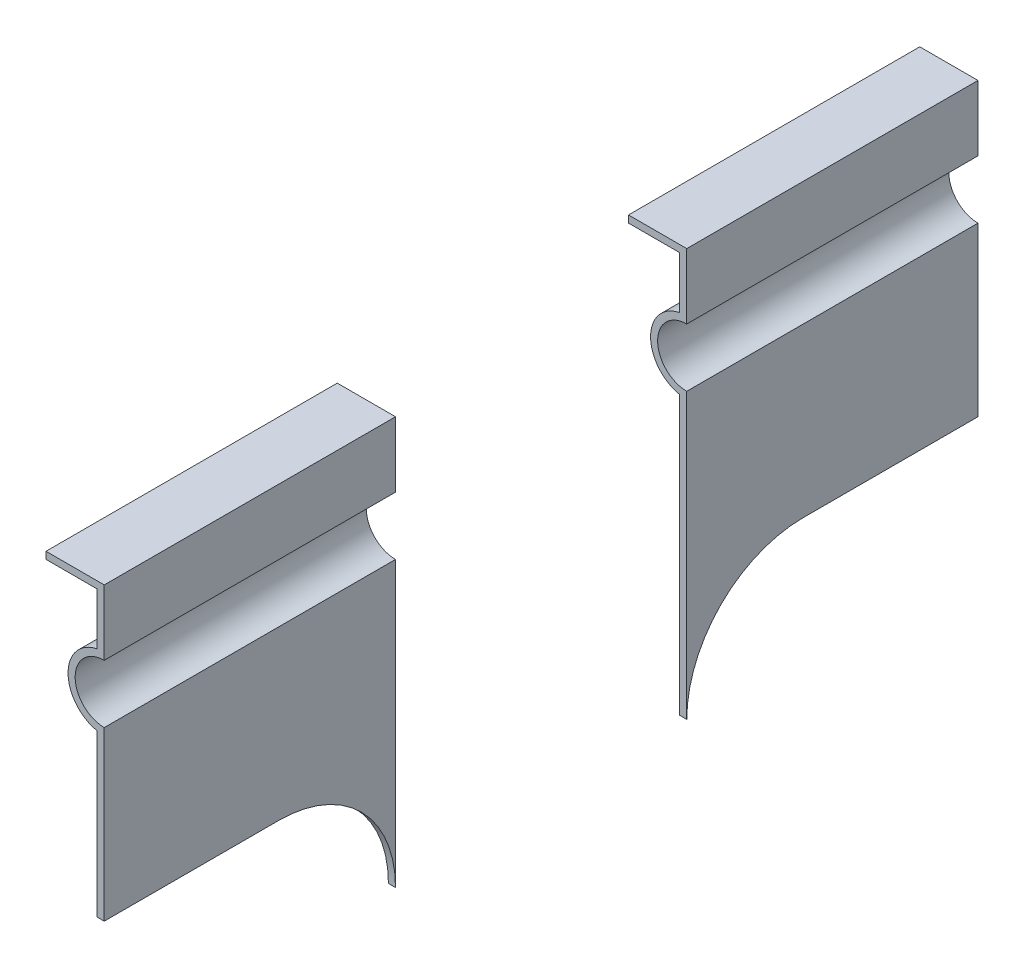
ISO-10303-21;
HEADER;
FILE_DESCRIPTION(('STEP AP214'),'2;1');
FILE_NAME('part.step','',(''),(''),'','','');
FILE_SCHEMA(('AUTOMOTIVE_DESIGN { 1 0 10303 214 1 1 1 1 }'));
ENDSEC;
DATA;
#1=APPLICATION_CONTEXT('core data for automotive mechanical design processes');
#2=APPLICATION_PROTOCOL_DEFINITION('international standard','automotive_design',2000,#1);
#3=PRODUCT_CONTEXT('',#1,'mechanical');
#4=PRODUCT('Part','Part','',(#3));
#5=PRODUCT_RELATED_PRODUCT_CATEGORY('part','',(#4));
#6=PRODUCT_DEFINITION_FORMATION('','',#4);
#7=PRODUCT_DEFINITION_CONTEXT('part definition',#1,'design');
#8=PRODUCT_DEFINITION('design','',#6,#7);
#9=PRODUCT_DEFINITION_SHAPE('','',#8);
#10=(LENGTH_UNIT() NAMED_UNIT(*) SI_UNIT(.MILLI.,.METRE.));
#11=(NAMED_UNIT(*) PLANE_ANGLE_UNIT() SI_UNIT($,.RADIAN.));
#12=(NAMED_UNIT(*) SI_UNIT($,.STERADIAN.) SOLID_ANGLE_UNIT());
#13=UNCERTAINTY_MEASURE_WITH_UNIT(LENGTH_MEASURE(1.E-05),#10,'distance_accuracy_value','');
#14=(GEOMETRIC_REPRESENTATION_CONTEXT(3) GLOBAL_UNCERTAINTY_ASSIGNED_CONTEXT((#13)) GLOBAL_UNIT_ASSIGNED_CONTEXT((#10,
#11,#12)) REPRESENTATION_CONTEXT('',''));
#15=CARTESIAN_POINT('',(0.,0.,0.));
#16=DIRECTION('',(0.,0.,1.));
#17=DIRECTION('',(1.,0.,0.));
#18=AXIS2_PLACEMENT_3D('',#15,#16,#17);
#19=CARTESIAN_POINT('',(151.214,-100.,50.));
#20=DIRECTION('',(0.,0.,1.));
#21=DIRECTION('',(0.,-1.,0.));
#22=AXIS2_PLACEMENT_3D('',#19,#20,#21);
#23=PLANE('',#22);
#24=DIRECTION('',(0.,-1.,0.));
#25=VECTOR('',#24,1.);
#26=CARTESIAN_POINT('',(0.,-100.,50.));
#27=LINE('',#26,#25);
#28=CARTESIAN_POINT('',(0.,-22.308259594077,50.));
#29=VERTEX_POINT('',#28);
#30=CARTESIAN_POINT('',(0.,-70.,50.));
#31=VERTEX_POINT('',#30);
#32=EDGE_CURVE('E156',#29,#31,#27,.T.);
#33=ORIENTED_EDGE('',*,*,#32,.T.);
#34=DIRECTION('',(1.,0.,0.));
#35=VECTOR('',#34,1.);
#36=CARTESIAN_POINT('',(-227.210876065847,-70.,50.));
#37=LINE('',#36,#35);
#38=CARTESIAN_POINT('',(1.21400000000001,-70.,50.));
#39=VERTEX_POINT('',#38);
#40=EDGE_CURVE('E49',#31,#39,#37,.T.);
#41=ORIENTED_EDGE('',*,*,#40,.T.);
#42=DIRECTION('',(0.,1.,0.));
#43=VECTOR('',#42,1.);
#44=CARTESIAN_POINT('',(1.214,-21.214,50.));
#45=LINE('',#44,#43);
#46=CARTESIAN_POINT('',(1.214,-21.214,50.));
#47=VERTEX_POINT('',#46);
#48=EDGE_CURVE('E90',#39,#47,#45,.T.);
#49=ORIENTED_EDGE('',*,*,#48,.T.);
#50=CARTESIAN_POINT('',(1.214,-16.214,50.));
#51=DIRECTION('',(0.,0.,1.));
#52=DIRECTION('',(0.,-1.,0.));
#53=AXIS2_PLACEMENT_3D('',#50,#51,#52);
#54=CIRCLE('',#53,5.);
#55=CARTESIAN_POINT('',(1.214,-11.214,50.));
#56=VERTEX_POINT('',#55);
#57=EDGE_CURVE('E161',#47,#56,#54,.F.);
#58=ORIENTED_EDGE('',*,*,#57,.T.);
#59=DIRECTION('',(0.,1.,0.));
#60=VECTOR('',#59,1.);
#61=CARTESIAN_POINT('',(1.214,-1.21399999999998,50.));
#62=LINE('',#61,#60);
#63=CARTESIAN_POINT('',(1.214,0.,50.));
#64=VERTEX_POINT('',#63);
#65=EDGE_CURVE('E178',#56,#64,#62,.T.);
#66=ORIENTED_EDGE('',*,*,#65,.T.);
#67=DIRECTION('',(-1.,0.,0.));
#68=VECTOR('',#67,1.);
#69=CARTESIAN_POINT('',(1.214,0.,50.));
#70=LINE('',#69,#68);
#71=CARTESIAN_POINT('',(-8.786,0.,50.));
#72=VERTEX_POINT('',#71);
#73=EDGE_CURVE('E176',#64,#72,#70,.T.);
#74=ORIENTED_EDGE('',*,*,#73,.T.);
#75=DIRECTION('',(0.,-1.,0.));
#76=VECTOR('',#75,1.);
#77=CARTESIAN_POINT('',(-8.786,0.,50.));
#78=LINE('',#77,#76);
#79=CARTESIAN_POINT('',(-8.786,-1.214,50.));
#80=VERTEX_POINT('',#79);
#81=EDGE_CURVE('E174',#72,#80,#78,.T.);
#82=ORIENTED_EDGE('',*,*,#81,.T.);
#83=DIRECTION('',(1.,0.,0.));
#84=VECTOR('',#83,1.);
#85=CARTESIAN_POINT('',(-8.786,-1.214,50.));
#86=LINE('',#85,#84);
#87=CARTESIAN_POINT('',(0.,-1.214,50.));
#88=VERTEX_POINT('',#87);
#89=EDGE_CURVE('E172',#80,#88,#86,.T.);
#90=ORIENTED_EDGE('',*,*,#89,.T.);
#91=DIRECTION('',(0.,-1.,0.));
#92=VECTOR('',#91,1.);
#93=CARTESIAN_POINT('',(0.,-1.21399999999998,50.));
#94=LINE('',#93,#92);
#95=CARTESIAN_POINT('',(0.,-10.119740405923,50.));
#96=VERTEX_POINT('',#95);
#97=EDGE_CURVE('E170',#88,#96,#94,.T.);
#98=ORIENTED_EDGE('',*,*,#97,.T.);
#99=CARTESIAN_POINT('',(1.214,-16.214,50.));
#100=DIRECTION('',(0.,0.,1.));
#101=DIRECTION('',(0.,-1.,0.));
#102=AXIS2_PLACEMENT_3D('',#99,#100,#101);
#103=CIRCLE('',#102,6.214);
#104=EDGE_CURVE('E65',#96,#29,#103,.T.);
#105=ORIENTED_EDGE('',*,*,#104,.T.);
#106=EDGE_LOOP('',(#33,#41,#49,#58,#66,#74,#82,#90,#98,#105));
#107=FACE_BOUND('',#106,.T.);
#108=ADVANCED_FACE('F41',(#107),#23,.T.);
#109=CARTESIAN_POINT('',(1.214,-16.214,150.));
#110=DIRECTION('',(0.,0.,-1.));
#111=DIRECTION('',(-1.,0.,0.));
#112=AXIS2_PLACEMENT_3D('',#109,#110,#111);
#113=CYLINDRICAL_SURFACE('',#112,5.);
#114=ORIENTED_EDGE('',*,*,#57,.F.);
#115=DIRECTION('',(0.,0.,-1.));
#116=VECTOR('',#115,1.);
#117=CARTESIAN_POINT('',(1.214,-21.214,150.));
#118=LINE('',#117,#116);
#119=CARTESIAN_POINT('',(1.214,-21.214,0.));
#120=VERTEX_POINT('',#119);
#121=EDGE_CURVE('E197',#47,#120,#118,.T.);
#122=ORIENTED_EDGE('',*,*,#121,.T.);
#123=CARTESIAN_POINT('',(1.214,-16.214,0.));
#124=DIRECTION('',(0.,0.,-1.));
#125=DIRECTION('',(1.,0.,0.));
#126=AXIS2_PLACEMENT_3D('',#123,#124,#125);
#127=CIRCLE('',#126,5.);
#128=CARTESIAN_POINT('',(1.214,-11.214,0.));
#129=VERTEX_POINT('',#128);
#130=EDGE_CURVE('E167',#120,#129,#127,.T.);
#131=ORIENTED_EDGE('',*,*,#130,.T.);
#132=DIRECTION('',(0.,0.,-1.));
#133=VECTOR('',#132,1.);
#134=CARTESIAN_POINT('',(1.214,-11.214,150.));
#135=LINE('',#134,#133);
#136=EDGE_CURVE('E126',#56,#129,#135,.T.);
#137=ORIENTED_EDGE('',*,*,#136,.F.);
#138=EDGE_LOOP('',(#114,#122,#131,#137));
#139=FACE_BOUND('',#138,.T.);
#140=ADVANCED_FACE('F43',(#139),#113,.F.);
#141=CARTESIAN_POINT('',(1.214,-1.214,150.));
#142=DIRECTION('',(-1.,0.,0.));
#143=DIRECTION('',(0.,-1.,0.));
#144=AXIS2_PLACEMENT_3D('',#141,#142,#143);
#145=PLANE('',#144);
#146=ORIENTED_EDGE('',*,*,#65,.F.);
#147=ORIENTED_EDGE('',*,*,#136,.T.);
#148=DIRECTION('',(0.,1.,0.));
#149=VECTOR('',#148,1.);
#150=CARTESIAN_POINT('',(1.214,-1.214,0.));
#151=LINE('',#150,#149);
#152=CARTESIAN_POINT('',(1.214,0.,0.));
#153=VERTEX_POINT('',#152);
#154=EDGE_CURVE('E182',#129,#153,#151,.T.);
#155=ORIENTED_EDGE('',*,*,#154,.T.);
#156=DIRECTION('',(0.,0.,-1.));
#157=VECTOR('',#156,1.);
#158=CARTESIAN_POINT('',(1.214,0.,150.));
#159=LINE('',#158,#157);
#160=EDGE_CURVE('E120',#64,#153,#159,.T.);
#161=ORIENTED_EDGE('',*,*,#160,.F.);
#162=EDGE_LOOP('',(#146,#147,#155,#161));
#163=FACE_BOUND('',#162,.T.);
#164=ADVANCED_FACE('F213',(#163),#145,.F.);
#165=CARTESIAN_POINT('',(1.214,0.,150.));
#166=DIRECTION('',(0.,-1.,0.));
#167=DIRECTION('',(1.,0.,0.));
#168=AXIS2_PLACEMENT_3D('',#165,#166,#167);
#169=PLANE('',#168);
#170=ORIENTED_EDGE('',*,*,#73,.F.);
#171=ORIENTED_EDGE('',*,*,#160,.T.);
#172=DIRECTION('',(-1.,0.,0.));
#173=VECTOR('',#172,1.);
#174=CARTESIAN_POINT('',(1.214,0.,0.));
#175=LINE('',#174,#173);
#176=CARTESIAN_POINT('',(-8.786,0.,0.));
#177=VERTEX_POINT('',#176);
#178=EDGE_CURVE('E184',#153,#177,#175,.T.);
#179=ORIENTED_EDGE('',*,*,#178,.T.);
#180=DIRECTION('',(0.,0.,-1.));
#181=VECTOR('',#180,1.);
#182=CARTESIAN_POINT('',(-8.786,0.,150.));
#183=LINE('',#182,#181);
#184=EDGE_CURVE('E185',#72,#177,#183,.T.);
#185=ORIENTED_EDGE('',*,*,#184,.F.);
#186=EDGE_LOOP('',(#170,#171,#179,#185));
#187=FACE_BOUND('',#186,.T.);
#188=ADVANCED_FACE('F219',(#187),#169,.F.);
#189=CARTESIAN_POINT('',(-8.786,0.,150.));
#190=DIRECTION('',(1.,0.,0.));
#191=DIRECTION('',(0.,0.,-1.));
#192=AXIS2_PLACEMENT_3D('',#189,#190,#191);
#193=PLANE('',#192);
#194=ORIENTED_EDGE('',*,*,#81,.F.);
#195=ORIENTED_EDGE('',*,*,#184,.T.);
#196=DIRECTION('',(0.,-1.,0.));
#197=VECTOR('',#196,1.);
#198=CARTESIAN_POINT('',(-8.786,0.,0.));
#199=LINE('',#198,#197);
#200=CARTESIAN_POINT('',(-8.786,-1.214,0.));
#201=VERTEX_POINT('',#200);
#202=EDGE_CURVE('E187',#177,#201,#199,.T.);
#203=ORIENTED_EDGE('',*,*,#202,.T.);
#204=DIRECTION('',(0.,0.,-1.));
#205=VECTOR('',#204,1.);
#206=CARTESIAN_POINT('',(-8.786,-1.214,150.));
#207=LINE('',#206,#205);
#208=EDGE_CURVE('E188',#80,#201,#207,.T.);
#209=ORIENTED_EDGE('',*,*,#208,.F.);
#210=EDGE_LOOP('',(#194,#195,#203,#209));
#211=FACE_BOUND('',#210,.T.);
#212=ADVANCED_FACE('F222',(#211),#193,.F.);
#213=CARTESIAN_POINT('',(-8.786,-1.214,150.));
#214=DIRECTION('',(0.,1.,0.));
#215=DIRECTION('',(0.,0.,1.));
#216=AXIS2_PLACEMENT_3D('',#213,#214,#215);
#217=PLANE('',#216);
#218=ORIENTED_EDGE('',*,*,#89,.F.);
#219=ORIENTED_EDGE('',*,*,#208,.T.);
#220=DIRECTION('',(1.,0.,0.));
#221=VECTOR('',#220,1.);
#222=CARTESIAN_POINT('',(-8.786,-1.214,0.));
#223=LINE('',#222,#221);
#224=CARTESIAN_POINT('',(0.,-1.214,0.));
#225=VERTEX_POINT('',#224);
#226=EDGE_CURVE('E190',#201,#225,#223,.T.);
#227=ORIENTED_EDGE('',*,*,#226,.T.);
#228=DIRECTION('',(0.,0.,-1.));
#229=VECTOR('',#228,1.);
#230=CARTESIAN_POINT('',(0.,-1.214,150.));
#231=LINE('',#230,#229);
#232=EDGE_CURVE('E191',#88,#225,#231,.T.);
#233=ORIENTED_EDGE('',*,*,#232,.F.);
#234=EDGE_LOOP('',(#218,#219,#227,#233));
#235=FACE_BOUND('',#234,.T.);
#236=ADVANCED_FACE('F228',(#235),#217,.F.);
#237=CARTESIAN_POINT('',(0.,-1.214,150.));
#238=DIRECTION('',(1.,0.,0.));
#239=DIRECTION('',(0.,1.,0.));
#240=AXIS2_PLACEMENT_3D('',#237,#238,#239);
#241=PLANE('',#240);
#242=ORIENTED_EDGE('',*,*,#97,.F.);
#243=ORIENTED_EDGE('',*,*,#232,.T.);
#244=DIRECTION('',(0.,-1.,0.));
#245=VECTOR('',#244,1.);
#246=CARTESIAN_POINT('',(0.,-1.214,0.));
#247=LINE('',#246,#245);
#248=CARTESIAN_POINT('',(0.,-10.119740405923,0.));
#249=VERTEX_POINT('',#248);
#250=EDGE_CURVE('E193',#225,#249,#247,.T.);
#251=ORIENTED_EDGE('',*,*,#250,.T.);
#252=DIRECTION('',(0.,0.,-1.));
#253=VECTOR('',#252,1.);
#254=CARTESIAN_POINT('',(0.,-10.119740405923,150.));
#255=LINE('',#254,#253);
#256=EDGE_CURVE('E194',#96,#249,#255,.T.);
#257=ORIENTED_EDGE('',*,*,#256,.F.);
#258=EDGE_LOOP('',(#242,#243,#251,#257));
#259=FACE_BOUND('',#258,.T.);
#260=ADVANCED_FACE('F231',(#259),#241,.F.);
#261=CARTESIAN_POINT('',(1.214,-16.214,150.));
#262=DIRECTION('',(0.,0.,-1.));
#263=DIRECTION('',(-1.,0.,0.));
#264=AXIS2_PLACEMENT_3D('',#261,#262,#263);
#265=CYLINDRICAL_SURFACE('',#264,6.214);
#266=ORIENTED_EDGE('',*,*,#104,.F.);
#267=ORIENTED_EDGE('',*,*,#256,.T.);
#268=CARTESIAN_POINT('',(1.214,-16.214,0.));
#269=DIRECTION('',(0.,0.,1.));
#270=DIRECTION('',(1.,0.,0.));
#271=AXIS2_PLACEMENT_3D('',#268,#269,#270);
#272=CIRCLE('',#271,6.214);
#273=CARTESIAN_POINT('',(0.,-22.308259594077,0.));
#274=VERTEX_POINT('',#273);
#275=EDGE_CURVE('E196',#249,#274,#272,.T.);
#276=ORIENTED_EDGE('',*,*,#275,.T.);
#277=DIRECTION('',(0.,0.,-1.));
#278=VECTOR('',#277,1.);
#279=CARTESIAN_POINT('',(0.,-22.308259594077,150.));
#280=LINE('',#279,#278);
#281=EDGE_CURVE('E98',#29,#274,#280,.T.);
#282=ORIENTED_EDGE('',*,*,#281,.F.);
#283=EDGE_LOOP('',(#266,#267,#276,#282));
#284=FACE_BOUND('',#283,.T.);
#285=ADVANCED_FACE('F235',(#284),#265,.T.);
#286=CARTESIAN_POINT('',(0.,-100.,150.));
#287=DIRECTION('',(1.,0.,0.));
#288=DIRECTION('',(0.,1.,0.));
#289=AXIS2_PLACEMENT_3D('',#286,#287,#288);
#290=PLANE('',#289);
#291=DIRECTION('',(0.,-1.,0.));
#292=VECTOR('',#291,1.);
#293=CARTESIAN_POINT('',(0.,-100.,0.));
#294=LINE('',#293,#292);
#295=CARTESIAN_POINT('',(0.,-50.,0.));
#296=VERTEX_POINT('',#295);
#297=EDGE_CURVE('E163',#274,#296,#294,.T.);
#298=ORIENTED_EDGE('',*,*,#297,.T.);
#299=DIRECTION('',(0.,0.,1.));
#300=VECTOR('',#299,1.);
#301=CARTESIAN_POINT('',(0.,-50.,150.));
#302=LINE('',#301,#300);
#303=CARTESIAN_POINT('',(0.,-50.,30.));
#304=VERTEX_POINT('',#303);
#305=EDGE_CURVE('E157',#296,#304,#302,.T.);
#306=ORIENTED_EDGE('',*,*,#305,.T.);
#307=CARTESIAN_POINT('',(0.,-70.,30.));
#308=DIRECTION('',(1.,0.,0.));
#309=DIRECTION('',(0.,1.,0.));
#310=AXIS2_PLACEMENT_3D('',#307,#308,#309);
#311=CIRCLE('',#310,20.);
#312=EDGE_CURVE('E151',#304,#31,#311,.T.);
#313=ORIENTED_EDGE('',*,*,#312,.T.);
#314=ORIENTED_EDGE('',*,*,#32,.F.);
#315=ORIENTED_EDGE('',*,*,#281,.T.);
#316=EDGE_LOOP('',(#298,#306,#313,#314,#315));
#317=FACE_BOUND('',#316,.T.);
#318=ADVANCED_FACE('F155',(#317),#290,.F.);
#319=CARTESIAN_POINT('',(1.214,-21.214,150.));
#320=DIRECTION('',(-1.,0.,0.));
#321=DIRECTION('',(0.,-1.,0.));
#322=AXIS2_PLACEMENT_3D('',#319,#320,#321);
#323=PLANE('',#322);
#324=CARTESIAN_POINT('',(1.21399999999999,-70.,30.));
#325=DIRECTION('',(-1.,0.,0.));
#326=DIRECTION('',(0.,-1.,0.));
#327=AXIS2_PLACEMENT_3D('',#324,#325,#326);
#328=CIRCLE('',#327,20.);
#329=CARTESIAN_POINT('',(1.21399999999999,-50.,30.));
#330=VERTEX_POINT('',#329);
#331=EDGE_CURVE('E56',#39,#330,#328,.T.);
#332=ORIENTED_EDGE('',*,*,#331,.T.);
#333=DIRECTION('',(0.,0.,-1.));
#334=VECTOR('',#333,1.);
#335=CARTESIAN_POINT('',(1.21400000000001,-50.,150.));
#336=LINE('',#335,#334);
#337=CARTESIAN_POINT('',(1.21400000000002,-50.,0.));
#338=VERTEX_POINT('',#337);
#339=EDGE_CURVE('E158',#330,#338,#336,.T.);
#340=ORIENTED_EDGE('',*,*,#339,.T.);
#341=DIRECTION('',(0.,1.,0.));
#342=VECTOR('',#341,1.);
#343=CARTESIAN_POINT('',(1.214,-21.214,0.));
#344=LINE('',#343,#342);
#345=EDGE_CURVE('E134',#338,#120,#344,.T.);
#346=ORIENTED_EDGE('',*,*,#345,.T.);
#347=ORIENTED_EDGE('',*,*,#121,.F.);
#348=ORIENTED_EDGE('',*,*,#48,.F.);
#349=EDGE_LOOP('',(#332,#340,#346,#347,#348));
#350=FACE_BOUND('',#349,.T.);
#351=ADVANCED_FACE('F237',(#350),#323,.F.);
#352=CARTESIAN_POINT('',(1.214,-16.214,0.));
#353=DIRECTION('',(0.,0.,1.));
#354=DIRECTION('',(1.,0.,0.));
#355=AXIS2_PLACEMENT_3D('',#352,#353,#354);
#356=PLANE('',#355);
#357=ORIENTED_EDGE('',*,*,#345,.F.);
#358=DIRECTION('',(-1.,0.,0.));
#359=VECTOR('',#358,1.);
#360=CARTESIAN_POINT('',(1.214,-50.,0.));
#361=LINE('',#360,#359);
#362=EDGE_CURVE('E12',#338,#296,#361,.T.);
#363=ORIENTED_EDGE('',*,*,#362,.T.);
#364=ORIENTED_EDGE('',*,*,#297,.F.);
#365=ORIENTED_EDGE('',*,*,#275,.F.);
#366=ORIENTED_EDGE('',*,*,#250,.F.);
#367=ORIENTED_EDGE('',*,*,#226,.F.);
#368=ORIENTED_EDGE('',*,*,#202,.F.);
#369=ORIENTED_EDGE('',*,*,#178,.F.);
#370=ORIENTED_EDGE('',*,*,#154,.F.);
#371=ORIENTED_EDGE('',*,*,#130,.F.);
#372=EDGE_LOOP('',(#357,#363,#364,#365,#366,#367,#368,#369,#370,#371));
#373=FACE_BOUND('',#372,.T.);
#374=ADVANCED_FACE('F216',(#373),#356,.F.);
#375=CARTESIAN_POINT('',(-227.210876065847,-50.,0.));
#376=DIRECTION('',(0.,1.,0.));
#377=DIRECTION('',(-1.,0.,0.));
#378=AXIS2_PLACEMENT_3D('',#375,#376,#377);
#379=PLANE('',#378);
#380=ORIENTED_EDGE('',*,*,#305,.F.);
#381=ORIENTED_EDGE('',*,*,#362,.F.);
#382=ORIENTED_EDGE('',*,*,#339,.F.);
#383=DIRECTION('',(1.,0.,0.));
#384=VECTOR('',#383,1.);
#385=CARTESIAN_POINT('',(-227.210876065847,-50.,30.));
#386=LINE('',#385,#384);
#387=EDGE_CURVE('E238',#304,#330,#386,.T.);
#388=ORIENTED_EDGE('',*,*,#387,.F.);
#389=EDGE_LOOP('',(#380,#381,#382,#388));
#390=FACE_BOUND('',#389,.T.);
#391=ADVANCED_FACE('F241',(#390),#379,.F.);
#392=CARTESIAN_POINT('',(-227.210876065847,-70.,30.));
#393=DIRECTION('',(1.,0.,0.));
#394=DIRECTION('',(0.,1.,0.));
#395=AXIS2_PLACEMENT_3D('',#392,#393,#394);
#396=CYLINDRICAL_SURFACE('',#395,20.);
#397=ORIENTED_EDGE('',*,*,#312,.F.);
#398=ORIENTED_EDGE('',*,*,#387,.T.);
#399=ORIENTED_EDGE('',*,*,#331,.F.);
#400=ORIENTED_EDGE('',*,*,#40,.F.);
#401=EDGE_LOOP('',(#397,#398,#399,#400));
#402=FACE_BOUND('',#401,.T.);
#403=ADVANCED_FACE('F150',(#402),#396,.F.);
#404=CLOSED_SHELL('',(#108,#140,#164,#188,#212,#236,#260,#285,#318,#351,#374,#391,#403));
#405=MANIFOLD_SOLID_BREP('B2',#404);
#406=CARTESIAN_POINT('',(1.214,-16.214,150.));
#407=DIRECTION('',(0.,0.,1.));
#408=DIRECTION('',(1.,0.,0.));
#409=AXIS2_PLACEMENT_3D('',#406,#407,#408);
#410=PLANE('',#409);
#411=DIRECTION('',(0.,-1.,0.));
#412=VECTOR('',#411,1.);
#413=CARTESIAN_POINT('',(0.,-100.,150.));
#414=LINE('',#413,#412);
#415=CARTESIAN_POINT('',(0.,-22.308259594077,150.));
#416=VERTEX_POINT('',#415);
#417=CARTESIAN_POINT('',(0.,-50.,150.));
#418=VERTEX_POINT('',#417);
#419=EDGE_CURVE('E489',#416,#418,#414,.T.);
#420=ORIENTED_EDGE('',*,*,#419,.T.);
#421=DIRECTION('',(1.,0.,0.));
#422=VECTOR('',#421,1.);
#423=CARTESIAN_POINT('',(-227.210876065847,-50.,150.));
#424=LINE('',#423,#422);
#425=CARTESIAN_POINT('',(1.21400000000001,-50.,150.));
#426=VERTEX_POINT('',#425);
#427=EDGE_CURVE('E373',#418,#426,#424,.T.);
#428=ORIENTED_EDGE('',*,*,#427,.T.);
#429=DIRECTION('',(0.,1.,0.));
#430=VECTOR('',#429,1.);
#431=CARTESIAN_POINT('',(1.214,-21.214,150.));
#432=LINE('',#431,#430);
#433=CARTESIAN_POINT('',(1.214,-21.214,150.));
#434=VERTEX_POINT('',#433);
#435=EDGE_CURVE('E491',#426,#434,#432,.T.);
#436=ORIENTED_EDGE('',*,*,#435,.T.);
#437=CARTESIAN_POINT('',(1.214,-16.214,150.));
#438=DIRECTION('',(0.,0.,-1.));
#439=DIRECTION('',(1.,0.,0.));
#440=AXIS2_PLACEMENT_3D('',#437,#438,#439);
#441=CIRCLE('',#440,5.);
#442=CARTESIAN_POINT('',(1.214,-11.214,150.));
#443=VERTEX_POINT('',#442);
#444=EDGE_CURVE('E474',#434,#443,#441,.T.);
#445=ORIENTED_EDGE('',*,*,#444,.T.);
#446=DIRECTION('',(0.,1.,0.));
#447=VECTOR('',#446,1.);
#448=CARTESIAN_POINT('',(1.214,-1.214,150.));
#449=LINE('',#448,#447);
#450=CARTESIAN_POINT('',(1.214,0.,150.));
#451=VERTEX_POINT('',#450);
#452=EDGE_CURVE('E477',#443,#451,#449,.T.);
#453=ORIENTED_EDGE('',*,*,#452,.T.);
#454=DIRECTION('',(-1.,0.,0.));
#455=VECTOR('',#454,1.);
#456=CARTESIAN_POINT('',(1.214,0.,150.));
#457=LINE('',#456,#455);
#458=CARTESIAN_POINT('',(-8.786,0.,150.));
#459=VERTEX_POINT('',#458);
#460=EDGE_CURVE('E479',#451,#459,#457,.T.);
#461=ORIENTED_EDGE('',*,*,#460,.T.);
#462=DIRECTION('',(0.,-1.,0.));
#463=VECTOR('',#462,1.);
#464=CARTESIAN_POINT('',(-8.786,0.,150.));
#465=LINE('',#464,#463);
#466=CARTESIAN_POINT('',(-8.786,-1.214,150.));
#467=VERTEX_POINT('',#466);
#468=EDGE_CURVE('E481',#459,#467,#465,.T.);
#469=ORIENTED_EDGE('',*,*,#468,.T.);
#470=DIRECTION('',(1.,0.,0.));
#471=VECTOR('',#470,1.);
#472=CARTESIAN_POINT('',(-8.786,-1.214,150.));
#473=LINE('',#472,#471);
#474=CARTESIAN_POINT('',(0.,-1.214,150.));
#475=VERTEX_POINT('',#474);
#476=EDGE_CURVE('E483',#467,#475,#473,.T.);
#477=ORIENTED_EDGE('',*,*,#476,.T.);
#478=DIRECTION('',(0.,-1.,0.));
#479=VECTOR('',#478,1.);
#480=CARTESIAN_POINT('',(0.,-1.214,150.));
#481=LINE('',#480,#479);
#482=CARTESIAN_POINT('',(0.,-10.119740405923,150.));
#483=VERTEX_POINT('',#482);
#484=EDGE_CURVE('E485',#475,#483,#481,.T.);
#485=ORIENTED_EDGE('',*,*,#484,.T.);
#486=CARTESIAN_POINT('',(1.214,-16.214,150.));
#487=DIRECTION('',(0.,0.,1.));
#488=DIRECTION('',(1.,0.,0.));
#489=AXIS2_PLACEMENT_3D('',#486,#487,#488);
#490=CIRCLE('',#489,6.214);
#491=EDGE_CURVE('E487',#483,#416,#490,.T.);
#492=ORIENTED_EDGE('',*,*,#491,.T.);
#493=EDGE_LOOP('',(#420,#428,#436,#445,#453,#461,#469,#477,#485,#492));
#494=FACE_BOUND('',#493,.T.);
#495=ADVANCED_FACE('F350',(#494),#410,.T.);
#496=CARTESIAN_POINT('',(1.214,-21.214,150.));
#497=DIRECTION('',(-1.,0.,0.));
#498=DIRECTION('',(0.,-1.,0.));
#499=AXIS2_PLACEMENT_3D('',#496,#497,#498);
#500=PLANE('',#499);
#501=DIRECTION('',(0.,0.,1.));
#502=VECTOR('',#501,1.);
#503=CARTESIAN_POINT('',(1.21400000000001,-50.,150.));
#504=LINE('',#503,#502);
#505=CARTESIAN_POINT('',(1.21399999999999,-50.,120.));
#506=VERTEX_POINT('',#505);
#507=EDGE_CURVE('E365',#506,#426,#504,.T.);
#508=ORIENTED_EDGE('',*,*,#507,.F.);
#509=CARTESIAN_POINT('',(1.21399999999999,-70.,120.));
#510=DIRECTION('',(-1.,0.,0.));
#511=DIRECTION('',(0.,-1.,0.));
#512=AXIS2_PLACEMENT_3D('',#509,#510,#511);
#513=CIRCLE('',#512,20.);
#514=CARTESIAN_POINT('',(1.21400000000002,-70.,100.));
#515=VERTEX_POINT('',#514);
#516=EDGE_CURVE('E443',#515,#506,#513,.F.);
#517=ORIENTED_EDGE('',*,*,#516,.F.);
#518=DIRECTION('',(0.,-1.,0.));
#519=VECTOR('',#518,1.);
#520=CARTESIAN_POINT('',(1.214,-21.214,100.));
#521=LINE('',#520,#519);
#522=CARTESIAN_POINT('',(1.214,-21.214,100.));
#523=VERTEX_POINT('',#522);
#524=EDGE_CURVE('E434',#523,#515,#521,.T.);
#525=ORIENTED_EDGE('',*,*,#524,.F.);
#526=DIRECTION('',(0.,0.,-1.));
#527=VECTOR('',#526,1.);
#528=CARTESIAN_POINT('',(1.214,-21.214,150.));
#529=LINE('',#528,#527);
#530=EDGE_CURVE('E493',#434,#523,#529,.T.);
#531=ORIENTED_EDGE('',*,*,#530,.F.);
#532=ORIENTED_EDGE('',*,*,#435,.F.);
#533=EDGE_LOOP('',(#508,#517,#525,#531,#532));
#534=FACE_BOUND('',#533,.T.);
#535=ADVANCED_FACE('F444',(#534),#500,.F.);
#536=CARTESIAN_POINT('',(0.,-100.,150.));
#537=DIRECTION('',(1.,0.,0.));
#538=DIRECTION('',(0.,1.,0.));
#539=AXIS2_PLACEMENT_3D('',#536,#537,#538);
#540=PLANE('',#539);
#541=DIRECTION('',(0.,0.,-1.));
#542=VECTOR('',#541,1.);
#543=CARTESIAN_POINT('',(0.,-50.,150.));
#544=LINE('',#543,#542);
#545=CARTESIAN_POINT('',(0.,-50.,120.));
#546=VERTEX_POINT('',#545);
#547=EDGE_CURVE('E39',#418,#546,#544,.T.);
#548=ORIENTED_EDGE('',*,*,#547,.F.);
#549=ORIENTED_EDGE('',*,*,#419,.F.);
#550=DIRECTION('',(0.,0.,-1.));
#551=VECTOR('',#550,1.);
#552=CARTESIAN_POINT('',(0.,-22.308259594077,150.));
#553=LINE('',#552,#551);
#554=CARTESIAN_POINT('',(0.,-22.308259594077,100.));
#555=VERTEX_POINT('',#554);
#556=EDGE_CURVE('E495',#416,#555,#553,.T.);
#557=ORIENTED_EDGE('',*,*,#556,.T.);
#558=DIRECTION('',(0.,1.,0.));
#559=VECTOR('',#558,1.);
#560=CARTESIAN_POINT('',(0.,-100.,100.));
#561=LINE('',#560,#559);
#562=CARTESIAN_POINT('',(0.,-70.,100.));
#563=VERTEX_POINT('',#562);
#564=EDGE_CURVE('E472',#563,#555,#561,.T.);
#565=ORIENTED_EDGE('',*,*,#564,.F.);
#566=CARTESIAN_POINT('',(0.,-70.,120.));
#567=DIRECTION('',(1.,0.,0.));
#568=DIRECTION('',(0.,1.,0.));
#569=AXIS2_PLACEMENT_3D('',#566,#567,#568);
#570=CIRCLE('',#569,20.);
#571=EDGE_CURVE('E448',#546,#563,#570,.F.);
#572=ORIENTED_EDGE('',*,*,#571,.F.);
#573=EDGE_LOOP('',(#548,#549,#557,#565,#572));
#574=FACE_BOUND('',#573,.T.);
#575=ADVANCED_FACE('F525',(#574),#540,.F.);
#576=CARTESIAN_POINT('',(1.214,-16.214,150.));
#577=DIRECTION('',(0.,0.,-1.));
#578=DIRECTION('',(-1.,0.,0.));
#579=AXIS2_PLACEMENT_3D('',#576,#577,#578);
#580=CYLINDRICAL_SURFACE('',#579,6.214);
#581=CARTESIAN_POINT('',(1.214,-16.214,100.));
#582=DIRECTION('',(0.,0.,-1.));
#583=DIRECTION('',(0.,1.,0.));
#584=AXIS2_PLACEMENT_3D('',#581,#582,#583);
#585=CIRCLE('',#584,6.214);
#586=CARTESIAN_POINT('',(0.,-10.119740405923,100.));
#587=VERTEX_POINT('',#586);
#588=EDGE_CURVE('E470',#555,#587,#585,.T.);
#589=ORIENTED_EDGE('',*,*,#588,.F.);
#590=ORIENTED_EDGE('',*,*,#556,.F.);
#591=ORIENTED_EDGE('',*,*,#491,.F.);
#592=DIRECTION('',(0.,0.,-1.));
#593=VECTOR('',#592,1.);
#594=CARTESIAN_POINT('',(0.,-10.119740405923,150.));
#595=LINE('',#594,#593);
#596=EDGE_CURVE('E498',#483,#587,#595,.T.);
#597=ORIENTED_EDGE('',*,*,#596,.T.);
#598=EDGE_LOOP('',(#589,#590,#591,#597));
#599=FACE_BOUND('',#598,.T.);
#600=ADVANCED_FACE('F532',(#599),#580,.T.);
#601=CARTESIAN_POINT('',(0.,-1.214,150.));
#602=DIRECTION('',(1.,0.,0.));
#603=DIRECTION('',(0.,1.,0.));
#604=AXIS2_PLACEMENT_3D('',#601,#602,#603);
#605=PLANE('',#604);
#606=DIRECTION('',(0.,1.,0.));
#607=VECTOR('',#606,1.);
#608=CARTESIAN_POINT('',(0.,-1.21399999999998,100.));
#609=LINE('',#608,#607);
#610=CARTESIAN_POINT('',(0.,-1.214,100.));
#611=VERTEX_POINT('',#610);
#612=EDGE_CURVE('E468',#587,#611,#609,.T.);
#613=ORIENTED_EDGE('',*,*,#612,.F.);
#614=ORIENTED_EDGE('',*,*,#596,.F.);
#615=ORIENTED_EDGE('',*,*,#484,.F.);
#616=DIRECTION('',(0.,0.,-1.));
#617=VECTOR('',#616,1.);
#618=CARTESIAN_POINT('',(0.,-1.214,150.));
#619=LINE('',#618,#617);
#620=EDGE_CURVE('E501',#475,#611,#619,.T.);
#621=ORIENTED_EDGE('',*,*,#620,.T.);
#622=EDGE_LOOP('',(#613,#614,#615,#621));
#623=FACE_BOUND('',#622,.T.);
#624=ADVANCED_FACE('F536',(#623),#605,.F.);
#625=CARTESIAN_POINT('',(-8.786,-1.214,150.));
#626=DIRECTION('',(0.,1.,0.));
#627=DIRECTION('',(0.,0.,1.));
#628=AXIS2_PLACEMENT_3D('',#625,#626,#627);
#629=PLANE('',#628);
#630=DIRECTION('',(-1.,0.,0.));
#631=VECTOR('',#630,1.);
#632=CARTESIAN_POINT('',(-8.786,-1.214,100.));
#633=LINE('',#632,#631);
#634=CARTESIAN_POINT('',(-8.786,-1.214,100.));
#635=VERTEX_POINT('',#634);
#636=EDGE_CURVE('E466',#611,#635,#633,.T.);
#637=ORIENTED_EDGE('',*,*,#636,.F.);
#638=ORIENTED_EDGE('',*,*,#620,.F.);
#639=ORIENTED_EDGE('',*,*,#476,.F.);
#640=DIRECTION('',(0.,0.,-1.));
#641=VECTOR('',#640,1.);
#642=CARTESIAN_POINT('',(-8.786,-1.214,150.));
#643=LINE('',#642,#641);
#644=EDGE_CURVE('E504',#467,#635,#643,.T.);
#645=ORIENTED_EDGE('',*,*,#644,.T.);
#646=EDGE_LOOP('',(#637,#638,#639,#645));
#647=FACE_BOUND('',#646,.T.);
#648=ADVANCED_FACE('F540',(#647),#629,.F.);
#649=CARTESIAN_POINT('',(-8.786,0.,150.));
#650=DIRECTION('',(1.,0.,0.));
#651=DIRECTION('',(0.,0.,-1.));
#652=AXIS2_PLACEMENT_3D('',#649,#650,#651);
#653=PLANE('',#652);
#654=DIRECTION('',(0.,1.,0.));
#655=VECTOR('',#654,1.);
#656=CARTESIAN_POINT('',(-8.786,0.,100.));
#657=LINE('',#656,#655);
#658=CARTESIAN_POINT('',(-8.786,0.,100.));
#659=VERTEX_POINT('',#658);
#660=EDGE_CURVE('E464',#635,#659,#657,.T.);
#661=ORIENTED_EDGE('',*,*,#660,.F.);
#662=ORIENTED_EDGE('',*,*,#644,.F.);
#663=ORIENTED_EDGE('',*,*,#468,.F.);
#664=DIRECTION('',(0.,0.,-1.));
#665=VECTOR('',#664,1.);
#666=CARTESIAN_POINT('',(-8.786,0.,150.));
#667=LINE('',#666,#665);
#668=EDGE_CURVE('E507',#459,#659,#667,.T.);
#669=ORIENTED_EDGE('',*,*,#668,.T.);
#670=EDGE_LOOP('',(#661,#662,#663,#669));
#671=FACE_BOUND('',#670,.T.);
#672=ADVANCED_FACE('F545',(#671),#653,.F.);
#673=CARTESIAN_POINT('',(1.214,0.,150.));
#674=DIRECTION('',(0.,-1.,0.));
#675=DIRECTION('',(1.,0.,0.));
#676=AXIS2_PLACEMENT_3D('',#673,#674,#675);
#677=PLANE('',#676);
#678=DIRECTION('',(1.,0.,0.));
#679=VECTOR('',#678,1.);
#680=CARTESIAN_POINT('',(1.214,0.,100.));
#681=LINE('',#680,#679);
#682=CARTESIAN_POINT('',(1.214,0.,100.));
#683=VERTEX_POINT('',#682);
#684=EDGE_CURVE('E462',#659,#683,#681,.T.);
#685=ORIENTED_EDGE('',*,*,#684,.F.);
#686=ORIENTED_EDGE('',*,*,#668,.F.);
#687=ORIENTED_EDGE('',*,*,#460,.F.);
#688=DIRECTION('',(0.,0.,-1.));
#689=VECTOR('',#688,1.);
#690=CARTESIAN_POINT('',(1.214,0.,150.));
#691=LINE('',#690,#689);
#692=EDGE_CURVE('E510',#451,#683,#691,.T.);
#693=ORIENTED_EDGE('',*,*,#692,.T.);
#694=EDGE_LOOP('',(#685,#686,#687,#693));
#695=FACE_BOUND('',#694,.T.);
#696=ADVANCED_FACE('F550',(#695),#677,.F.);
#697=CARTESIAN_POINT('',(1.214,-1.214,150.));
#698=DIRECTION('',(-1.,0.,0.));
#699=DIRECTION('',(0.,-1.,0.));
#700=AXIS2_PLACEMENT_3D('',#697,#698,#699);
#701=PLANE('',#700);
#702=DIRECTION('',(0.,-1.,0.));
#703=VECTOR('',#702,1.);
#704=CARTESIAN_POINT('',(1.214,-1.21399999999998,100.));
#705=LINE('',#704,#703);
#706=CARTESIAN_POINT('',(1.214,-11.214,100.));
#707=VERTEX_POINT('',#706);
#708=EDGE_CURVE('E460',#683,#707,#705,.T.);
#709=ORIENTED_EDGE('',*,*,#708,.F.);
#710=ORIENTED_EDGE('',*,*,#692,.F.);
#711=ORIENTED_EDGE('',*,*,#452,.F.);
#712=DIRECTION('',(0.,0.,-1.));
#713=VECTOR('',#712,1.);
#714=CARTESIAN_POINT('',(1.214,-11.214,150.));
#715=LINE('',#714,#713);
#716=EDGE_CURVE('E442',#443,#707,#715,.T.);
#717=ORIENTED_EDGE('',*,*,#716,.T.);
#718=EDGE_LOOP('',(#709,#710,#711,#717));
#719=FACE_BOUND('',#718,.T.);
#720=ADVANCED_FACE('F517',(#719),#701,.F.);
#721=CARTESIAN_POINT('',(1.214,-16.214,150.));
#722=DIRECTION('',(0.,0.,-1.));
#723=DIRECTION('',(-1.,0.,0.));
#724=AXIS2_PLACEMENT_3D('',#721,#722,#723);
#725=CYLINDRICAL_SURFACE('',#724,5.);
#726=CARTESIAN_POINT('',(1.214,-16.214,100.));
#727=DIRECTION('',(0.,0.,-1.));
#728=DIRECTION('',(0.,1.,0.));
#729=AXIS2_PLACEMENT_3D('',#726,#727,#728);
#730=CIRCLE('',#729,5.);
#731=EDGE_CURVE('E439',#707,#523,#730,.F.);
#732=ORIENTED_EDGE('',*,*,#731,.F.);
#733=ORIENTED_EDGE('',*,*,#716,.F.);
#734=ORIENTED_EDGE('',*,*,#444,.F.);
#735=ORIENTED_EDGE('',*,*,#530,.T.);
#736=EDGE_LOOP('',(#732,#733,#734,#735));
#737=FACE_BOUND('',#736,.T.);
#738=ADVANCED_FACE('F352',(#737),#725,.F.);
#739=CARTESIAN_POINT('',(151.214,86.8550946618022,100.));
#740=DIRECTION('',(0.,0.,-1.));
#741=DIRECTION('',(0.,1.,0.));
#742=AXIS2_PLACEMENT_3D('',#739,#740,#741);
#743=PLANE('',#742);
#744=DIRECTION('',(1.,0.,0.));
#745=VECTOR('',#744,1.);
#746=CARTESIAN_POINT('',(-227.210876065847,-70.,100.));
#747=LINE('',#746,#745);
#748=EDGE_CURVE('E358',#563,#515,#747,.T.);
#749=ORIENTED_EDGE('',*,*,#748,.F.);
#750=ORIENTED_EDGE('',*,*,#564,.T.);
#751=ORIENTED_EDGE('',*,*,#588,.T.);
#752=ORIENTED_EDGE('',*,*,#612,.T.);
#753=ORIENTED_EDGE('',*,*,#636,.T.);
#754=ORIENTED_EDGE('',*,*,#660,.T.);
#755=ORIENTED_EDGE('',*,*,#684,.T.);
#756=ORIENTED_EDGE('',*,*,#708,.T.);
#757=ORIENTED_EDGE('',*,*,#731,.T.);
#758=ORIENTED_EDGE('',*,*,#524,.T.);
#759=EDGE_LOOP('',(#749,#750,#751,#752,#753,#754,#755,#756,#757,#758));
#760=FACE_BOUND('',#759,.T.);
#761=ADVANCED_FACE('F435',(#760),#743,.T.);
#762=CARTESIAN_POINT('',(-227.210876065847,-50.,150.));
#763=DIRECTION('',(0.,-1.,0.));
#764=DIRECTION('',(0.,0.,-1.));
#765=AXIS2_PLACEMENT_3D('',#762,#763,#764);
#766=PLANE('',#765);
#767=DIRECTION('',(1.,0.,0.));
#768=VECTOR('',#767,1.);
#769=CARTESIAN_POINT('',(-227.210876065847,-50.,120.));
#770=LINE('',#769,#768);
#771=EDGE_CURVE('E454',#546,#506,#770,.T.);
#772=ORIENTED_EDGE('',*,*,#771,.T.);
#773=ORIENTED_EDGE('',*,*,#507,.T.);
#774=ORIENTED_EDGE('',*,*,#427,.F.);
#775=ORIENTED_EDGE('',*,*,#547,.T.);
#776=EDGE_LOOP('',(#772,#773,#774,#775));
#777=FACE_BOUND('',#776,.T.);
#778=ADVANCED_FACE('F522',(#777),#766,.T.);
#779=CARTESIAN_POINT('',(-227.210876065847,-70.,120.));
#780=DIRECTION('',(1.,0.,0.));
#781=DIRECTION('',(0.,1.,0.));
#782=AXIS2_PLACEMENT_3D('',#779,#780,#781);
#783=CYLINDRICAL_SURFACE('',#782,20.);
#784=ORIENTED_EDGE('',*,*,#748,.T.);
#785=ORIENTED_EDGE('',*,*,#516,.T.);
#786=ORIENTED_EDGE('',*,*,#771,.F.);
#787=ORIENTED_EDGE('',*,*,#571,.T.);
#788=EDGE_LOOP('',(#784,#785,#786,#787));
#789=FACE_BOUND('',#788,.T.);
#790=ADVANCED_FACE('F451',(#789),#783,.F.);
#791=CLOSED_SHELL('',(#495,#535,#575,#600,#624,#648,#672,#696,#720,#738,#761,#778,#790));
#792=MANIFOLD_SOLID_BREP('B6',#791);
#793=ADVANCED_BREP_SHAPE_REPRESENTATION('',(#18,#405,#792),#14);
#794=SHAPE_DEFINITION_REPRESENTATION(#9,#793);
ENDSEC;
END-ISO-10303-21;
